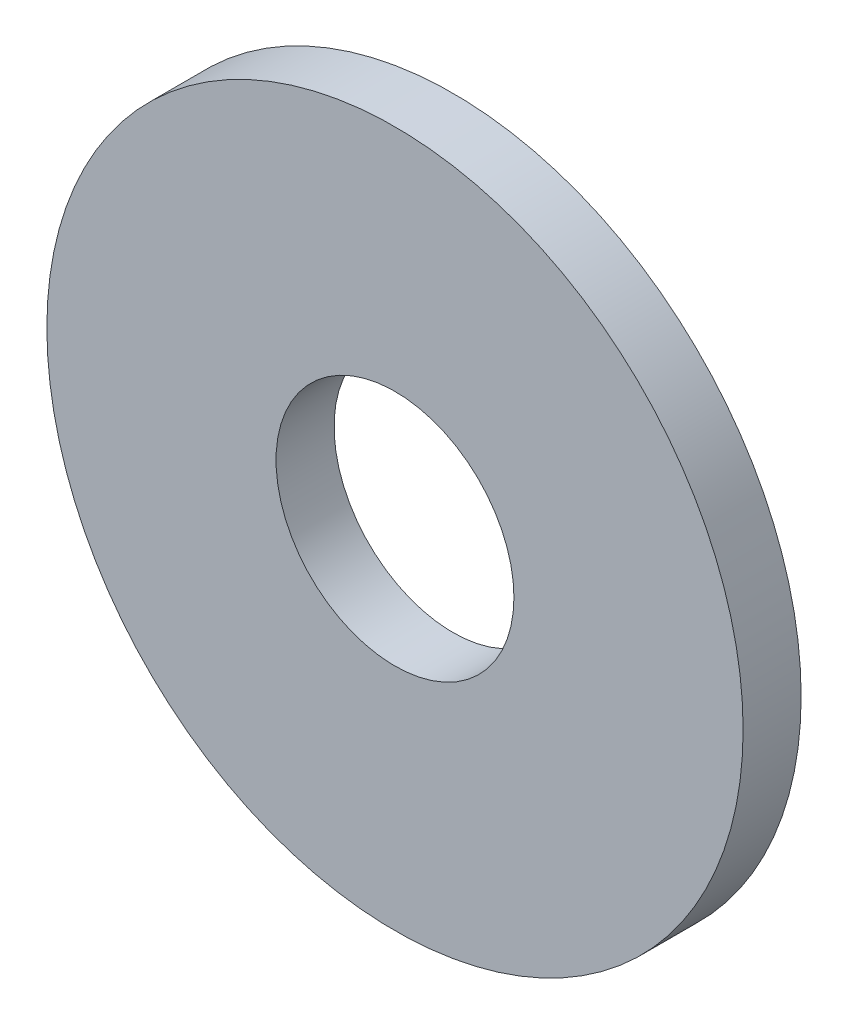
from build123d import *

# Parameters (mm, degrees)
ESQUISSE1_R          = 6
ESQUISSE1_R_2        = 2.05
BASE_EXTRUSION_DEPTH = 1


with BuildPart() as part:
    # Esquisse1 → Base-Extrusion (new body)
    with BuildSketch(Plane.XY):
        Circle(ESQUISSE1_R)
        Circle(ESQUISSE1_R_2, mode=Mode.SUBTRACT)
    extrude(amount=BASE_EXTRUSION_DEPTH)


solid = part.part
